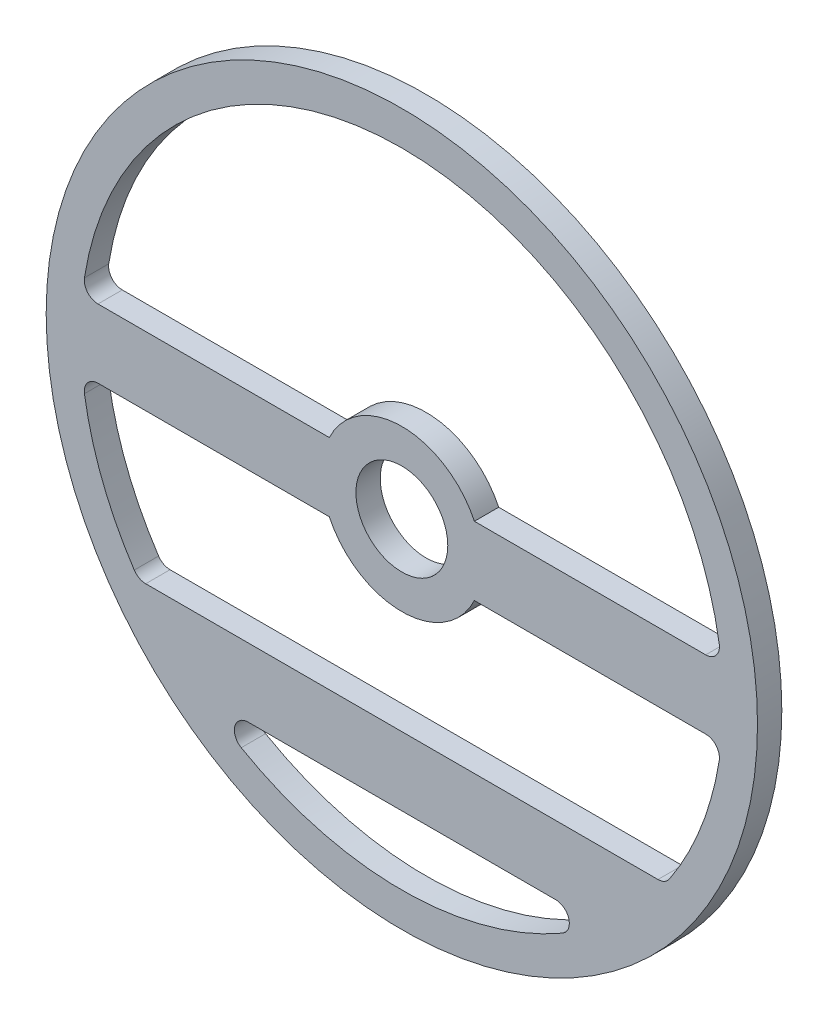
ISO-10303-21;
HEADER;
FILE_DESCRIPTION(('STEP AP214'),'2;1');
FILE_NAME('part.step','',(''),(''),'','','');
FILE_SCHEMA(('AUTOMOTIVE_DESIGN { 1 0 10303 214 1 1 1 1 }'));
ENDSEC;
DATA;
#1=APPLICATION_CONTEXT('core data for automotive mechanical design processes');
#2=APPLICATION_PROTOCOL_DEFINITION('international standard','automotive_design',2000,#1);
#3=PRODUCT_CONTEXT('',#1,'mechanical');
#4=PRODUCT('Part','Part','',(#3));
#5=PRODUCT_RELATED_PRODUCT_CATEGORY('part','',(#4));
#6=PRODUCT_DEFINITION_FORMATION('','',#4);
#7=PRODUCT_DEFINITION_CONTEXT('part definition',#1,'design');
#8=PRODUCT_DEFINITION('design','',#6,#7);
#9=PRODUCT_DEFINITION_SHAPE('','',#8);
#10=(LENGTH_UNIT() NAMED_UNIT(*) SI_UNIT(.MILLI.,.METRE.));
#11=(NAMED_UNIT(*) PLANE_ANGLE_UNIT() SI_UNIT($,.RADIAN.));
#12=(NAMED_UNIT(*) SI_UNIT($,.STERADIAN.) SOLID_ANGLE_UNIT());
#13=UNCERTAINTY_MEASURE_WITH_UNIT(LENGTH_MEASURE(1.E-05),#10,'distance_accuracy_value','');
#14=(GEOMETRIC_REPRESENTATION_CONTEXT(3) GLOBAL_UNCERTAINTY_ASSIGNED_CONTEXT((#13)) GLOBAL_UNIT_ASSIGNED_CONTEXT((#10,
#11,#12)) REPRESENTATION_CONTEXT('',''));
#15=CARTESIAN_POINT('',(0.,0.,0.));
#16=DIRECTION('',(0.,0.,1.));
#17=DIRECTION('',(1.,0.,0.));
#18=AXIS2_PLACEMENT_3D('',#15,#16,#17);
#19=CARTESIAN_POINT('',(0.,0.,4.5));
#20=DIRECTION('',(0.,0.,-1.));
#21=DIRECTION('',(-1.,0.,0.));
#22=AXIS2_PLACEMENT_3D('',#19,#20,#21);
#23=CYLINDRICAL_SURFACE('',#22,14.85);
#24=CARTESIAN_POINT('',(0.,0.,0.));
#25=DIRECTION('',(0.,0.,1.));
#26=DIRECTION('',(1.,0.,0.));
#27=AXIS2_PLACEMENT_3D('',#24,#25,#26);
#28=CIRCLE('',#27,14.85);
#29=CARTESIAN_POINT('',(-13.4238593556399,-6.35,0.));
#30=VERTEX_POINT('',#29);
#31=CARTESIAN_POINT('',(13.4238593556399,-6.35,0.));
#32=VERTEX_POINT('',#31);
#33=EDGE_CURVE('E325',#30,#32,#28,.T.);
#34=ORIENTED_EDGE('',*,*,#33,.T.);
#35=DIRECTION('',(0.,0.,-1.));
#36=VECTOR('',#35,1.);
#37=CARTESIAN_POINT('',(13.4238593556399,-6.35,4.5));
#38=LINE('',#37,#36);
#39=CARTESIAN_POINT('',(13.4238593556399,-6.35,4.5));
#40=VERTEX_POINT('',#39);
#41=EDGE_CURVE('E202',#40,#32,#38,.T.);
#42=ORIENTED_EDGE('',*,*,#41,.F.);
#43=CARTESIAN_POINT('',(0.,0.,4.5));
#44=DIRECTION('',(0.,0.,1.));
#45=DIRECTION('',(1.,0.,0.));
#46=AXIS2_PLACEMENT_3D('',#43,#44,#45);
#47=CIRCLE('',#46,14.85);
#48=CARTESIAN_POINT('',(-13.4238593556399,-6.35,4.5));
#49=VERTEX_POINT('',#48);
#50=EDGE_CURVE('E194',#49,#40,#47,.T.);
#51=ORIENTED_EDGE('',*,*,#50,.F.);
#52=DIRECTION('',(0.,0.,-1.));
#53=VECTOR('',#52,1.);
#54=CARTESIAN_POINT('',(-13.4238593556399,-6.35,4.5));
#55=LINE('',#54,#53);
#56=EDGE_CURVE('E199',#49,#30,#55,.T.);
#57=ORIENTED_EDGE('',*,*,#56,.T.);
#58=EDGE_LOOP('',(#34,#42,#51,#57));
#59=FACE_BOUND('',#58,.T.);
#60=ADVANCED_FACE('F35',(#59),#23,.T.);
#61=CARTESIAN_POINT('',(0.,-6.35,4.5));
#62=DIRECTION('',(0.,-1.,0.));
#63=DIRECTION('',(1.,0.,0.));
#64=AXIS2_PLACEMENT_3D('',#61,#62,#63);
#65=PLANE('',#64);
#66=DIRECTION('',(-1.,0.,0.));
#67=VECTOR('',#66,1.);
#68=CARTESIAN_POINT('',(0.,-6.35,0.));
#69=LINE('',#68,#67);
#70=CARTESIAN_POINT('',(56.234996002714,-6.34999999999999,0.));
#71=VERTEX_POINT('',#70);
#72=EDGE_CURVE('E313',#71,#32,#69,.T.);
#73=ORIENTED_EDGE('',*,*,#72,.F.);
#74=DIRECTION('',(0.,0.,1.));
#75=VECTOR('',#74,1.);
#76=CARTESIAN_POINT('',(56.234996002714,-6.34999999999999,4.5));
#77=LINE('',#76,#75);
#78=CARTESIAN_POINT('',(56.234996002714,-6.34999999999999,4.5));
#79=VERTEX_POINT('',#78);
#80=EDGE_CURVE('E230',#71,#79,#77,.T.);
#81=ORIENTED_EDGE('',*,*,#80,.T.);
#82=DIRECTION('',(-1.,0.,0.));
#83=VECTOR('',#82,1.);
#84=CARTESIAN_POINT('',(0.,-6.35,4.5));
#85=LINE('',#84,#83);
#86=EDGE_CURVE('E341',#79,#40,#85,.T.);
#87=ORIENTED_EDGE('',*,*,#86,.T.);
#88=ORIENTED_EDGE('',*,*,#41,.T.);
#89=EDGE_LOOP('',(#73,#81,#87,#88));
#90=FACE_BOUND('',#89,.T.);
#91=ADVANCED_FACE('F338',(#90),#65,.T.);
#92=CARTESIAN_POINT('',(0.,0.,4.5));
#93=DIRECTION('',(0.,0.,-1.));
#94=DIRECTION('',(-1.,0.,0.));
#95=AXIS2_PLACEMENT_3D('',#92,#93,#94);
#96=CYLINDRICAL_SURFACE('',#95,59.4733546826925);
#97=CARTESIAN_POINT('',(0.,0.,4.5));
#98=DIRECTION('',(0.,0.,1.));
#99=DIRECTION('',(1.,0.,0.));
#100=AXIS2_PLACEMENT_3D('',#97,#98,#99);
#101=CIRCLE('',#100,59.4733546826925);
#102=CARTESIAN_POINT('',(49.5179271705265,-32.9401700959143,4.5));
#103=VERTEX_POINT('',#102);
#104=CARTESIAN_POINT('',(58.7438397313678,-9.28661460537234,4.5));
#105=VERTEX_POINT('',#104);
#106=EDGE_CURVE('E353',#103,#105,#101,.T.);
#107=ORIENTED_EDGE('',*,*,#106,.T.);
#108=DIRECTION('',(0.,0.,-1.));
#109=VECTOR('',#108,1.);
#110=CARTESIAN_POINT('',(58.7438397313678,-9.28661460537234,4.5));
#111=LINE('',#110,#109);
#112=CARTESIAN_POINT('',(58.7438397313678,-9.28661460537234,0.));
#113=VERTEX_POINT('',#112);
#114=EDGE_CURVE('E227',#105,#113,#111,.T.);
#115=ORIENTED_EDGE('',*,*,#114,.T.);
#116=CARTESIAN_POINT('',(0.,0.,0.));
#117=DIRECTION('',(0.,0.,1.));
#118=DIRECTION('',(1.,0.,0.));
#119=AXIS2_PLACEMENT_3D('',#116,#117,#118);
#120=CIRCLE('',#119,59.4733546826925);
#121=CARTESIAN_POINT('',(49.5179271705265,-32.9401700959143,0.));
#122=VERTEX_POINT('',#121);
#123=EDGE_CURVE('E304',#122,#113,#120,.T.);
#124=ORIENTED_EDGE('',*,*,#123,.F.);
#125=DIRECTION('',(0.,0.,-1.));
#126=VECTOR('',#125,1.);
#127=CARTESIAN_POINT('',(49.5179271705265,-32.9401700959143,4.5));
#128=LINE('',#127,#126);
#129=EDGE_CURVE('E225',#122,#103,#128,.F.);
#130=ORIENTED_EDGE('',*,*,#129,.T.);
#131=EDGE_LOOP('',(#107,#115,#124,#130));
#132=FACE_BOUND('',#131,.T.);
#133=ADVANCED_FACE('F350',(#132),#96,.F.);
#134=CARTESIAN_POINT('',(0.,-34.0733546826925,4.5));
#135=DIRECTION('',(0.,1.,0.));
#136=DIRECTION('',(-1.,0.,0.));
#137=AXIS2_PLACEMENT_3D('',#134,#135,#136);
#138=PLANE('',#137);
#139=DIRECTION('',(1.,0.,0.));
#140=VECTOR('',#139,1.);
#141=CARTESIAN_POINT('',(0.,-34.0733546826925,4.5));
#142=LINE('',#141,#140);
#143=CARTESIAN_POINT('',(-47.4031055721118,-34.0733546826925,4.5));
#144=VERTEX_POINT('',#143);
#145=CARTESIAN_POINT('',(47.4031055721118,-34.0733546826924,4.5));
#146=VERTEX_POINT('',#145);
#147=EDGE_CURVE('E355',#144,#146,#142,.T.);
#148=ORIENTED_EDGE('',*,*,#147,.T.);
#149=DIRECTION('',(0.,0.,1.));
#150=VECTOR('',#149,1.);
#151=CARTESIAN_POINT('',(47.4031055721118,-34.0733546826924,0.));
#152=LINE('',#151,#150);
#153=CARTESIAN_POINT('',(47.4031055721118,-34.0733546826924,0.));
#154=VERTEX_POINT('',#153);
#155=EDGE_CURVE('E234',#146,#154,#152,.F.);
#156=ORIENTED_EDGE('',*,*,#155,.T.);
#157=DIRECTION('',(1.,0.,0.));
#158=VECTOR('',#157,1.);
#159=CARTESIAN_POINT('',(0.,-34.0733546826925,0.));
#160=LINE('',#159,#158);
#161=CARTESIAN_POINT('',(-47.4031055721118,-34.0733546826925,0.));
#162=VERTEX_POINT('',#161);
#163=EDGE_CURVE('E302',#162,#154,#160,.T.);
#164=ORIENTED_EDGE('',*,*,#163,.F.);
#165=DIRECTION('',(0.,0.,1.));
#166=VECTOR('',#165,1.);
#167=CARTESIAN_POINT('',(-47.4031055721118,-34.0733546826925,4.5));
#168=LINE('',#167,#166);
#169=EDGE_CURVE('E232',#162,#144,#168,.T.);
#170=ORIENTED_EDGE('',*,*,#169,.T.);
#171=EDGE_LOOP('',(#148,#156,#164,#170));
#172=FACE_BOUND('',#171,.T.);
#173=ADVANCED_FACE('F419',(#172),#138,.T.);
#174=CARTESIAN_POINT('',(-58.7438397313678,-9.28661460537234,4.5));
#175=VERTEX_POINT('',#174);
#176=CARTESIAN_POINT('',(-49.5179271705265,-32.9401700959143,4.5));
#177=VERTEX_POINT('',#176);
#178=EDGE_CURVE('E281',#175,#177,#101,.T.);
#179=ORIENTED_EDGE('',*,*,#178,.T.);
#180=DIRECTION('',(0.,0.,-1.));
#181=VECTOR('',#180,1.);
#182=CARTESIAN_POINT('',(-49.5179271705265,-32.9401700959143,4.5));
#183=LINE('',#182,#181);
#184=CARTESIAN_POINT('',(-49.5179271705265,-32.9401700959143,0.));
#185=VERTEX_POINT('',#184);
#186=EDGE_CURVE('E239',#177,#185,#183,.T.);
#187=ORIENTED_EDGE('',*,*,#186,.T.);
#188=CARTESIAN_POINT('',(-58.7438397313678,-9.28661460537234,0.));
#189=VERTEX_POINT('',#188);
#190=EDGE_CURVE('E297',#189,#185,#120,.T.);
#191=ORIENTED_EDGE('',*,*,#190,.F.);
#192=DIRECTION('',(0.,0.,-1.));
#193=VECTOR('',#192,1.);
#194=CARTESIAN_POINT('',(-58.7438397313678,-9.28661460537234,4.5));
#195=LINE('',#194,#193);
#196=EDGE_CURVE('E237',#189,#175,#195,.F.);
#197=ORIENTED_EDGE('',*,*,#196,.T.);
#198=EDGE_LOOP('',(#179,#187,#191,#197));
#199=FACE_BOUND('',#198,.T.);
#200=ADVANCED_FACE('F300',(#199),#96,.F.);
#201=CARTESIAN_POINT('',(0.,6.35,4.5));
#202=DIRECTION('',(0.,-1.,0.));
#203=DIRECTION('',(1.,0.,0.));
#204=AXIS2_PLACEMENT_3D('',#201,#202,#203);
#205=PLANE('',#204);
#206=DIRECTION('',(-1.,0.,0.));
#207=VECTOR('',#206,1.);
#208=CARTESIAN_POINT('',(0.,6.35,4.5));
#209=LINE('',#208,#207);
#210=CARTESIAN_POINT('',(56.234996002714,6.35,4.5));
#211=VERTEX_POINT('',#210);
#212=CARTESIAN_POINT('',(13.4238593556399,6.35,4.5));
#213=VERTEX_POINT('',#212);
#214=EDGE_CURVE('E170',#211,#213,#209,.T.);
#215=ORIENTED_EDGE('',*,*,#214,.F.);
#216=DIRECTION('',(0.,0.,-1.));
#217=VECTOR('',#216,1.);
#218=CARTESIAN_POINT('',(56.234996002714,6.35,4.5));
#219=LINE('',#218,#217);
#220=CARTESIAN_POINT('',(56.234996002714,6.35,0.));
#221=VERTEX_POINT('',#220);
#222=EDGE_CURVE('E218',#211,#221,#219,.T.);
#223=ORIENTED_EDGE('',*,*,#222,.T.);
#224=DIRECTION('',(-1.,0.,0.));
#225=VECTOR('',#224,1.);
#226=CARTESIAN_POINT('',(0.,6.35,0.));
#227=LINE('',#226,#225);
#228=CARTESIAN_POINT('',(13.4238593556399,6.35,0.));
#229=VERTEX_POINT('',#228);
#230=EDGE_CURVE('E197',#221,#229,#227,.T.);
#231=ORIENTED_EDGE('',*,*,#230,.T.);
#232=DIRECTION('',(0.,0.,-1.));
#233=VECTOR('',#232,1.);
#234=CARTESIAN_POINT('',(13.4238593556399,6.35,4.5));
#235=LINE('',#234,#233);
#236=EDGE_CURVE('E189',#213,#229,#235,.T.);
#237=ORIENTED_EDGE('',*,*,#236,.F.);
#238=EDGE_LOOP('',(#215,#223,#231,#237));
#239=FACE_BOUND('',#238,.T.);
#240=ADVANCED_FACE('F195',(#239),#205,.F.);
#241=CARTESIAN_POINT('',(-13.4238593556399,6.35,0.));
#242=VERTEX_POINT('',#241);
#243=EDGE_CURVE('E319',#229,#242,#28,.T.);
#244=ORIENTED_EDGE('',*,*,#243,.T.);
#245=DIRECTION('',(0.,0.,-1.));
#246=VECTOR('',#245,1.);
#247=CARTESIAN_POINT('',(-13.4238593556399,6.35,4.5));
#248=LINE('',#247,#246);
#249=CARTESIAN_POINT('',(-13.4238593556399,6.35,4.5));
#250=VERTEX_POINT('',#249);
#251=EDGE_CURVE('E191',#250,#242,#248,.T.);
#252=ORIENTED_EDGE('',*,*,#251,.F.);
#253=EDGE_CURVE('E175',#213,#250,#47,.T.);
#254=ORIENTED_EDGE('',*,*,#253,.F.);
#255=ORIENTED_EDGE('',*,*,#236,.T.);
#256=EDGE_LOOP('',(#244,#252,#254,#255));
#257=FACE_BOUND('',#256,.T.);
#258=ADVANCED_FACE('F188',(#257),#23,.T.);
#259=CARTESIAN_POINT('',(0.,6.35,4.5));
#260=DIRECTION('',(0.,1.,0.));
#261=DIRECTION('',(-1.,0.,0.));
#262=AXIS2_PLACEMENT_3D('',#259,#260,#261);
#263=PLANE('',#262);
#264=DIRECTION('',(1.,0.,0.));
#265=VECTOR('',#264,1.);
#266=CARTESIAN_POINT('',(0.,6.35,0.));
#267=LINE('',#266,#265);
#268=CARTESIAN_POINT('',(-56.234996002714,6.35,0.));
#269=VERTEX_POINT('',#268);
#270=EDGE_CURVE('E322',#269,#242,#267,.T.);
#271=ORIENTED_EDGE('',*,*,#270,.F.);
#272=DIRECTION('',(0.,0.,1.));
#273=VECTOR('',#272,1.);
#274=CARTESIAN_POINT('',(-56.234996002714,6.35,4.5));
#275=LINE('',#274,#273);
#276=CARTESIAN_POINT('',(-56.234996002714,6.35,4.5));
#277=VERTEX_POINT('',#276);
#278=EDGE_CURVE('E50',#269,#277,#275,.T.);
#279=ORIENTED_EDGE('',*,*,#278,.T.);
#280=DIRECTION('',(1.,0.,0.));
#281=VECTOR('',#280,1.);
#282=CARTESIAN_POINT('',(0.,6.35,4.5));
#283=LINE('',#282,#281);
#284=EDGE_CURVE('E192',#277,#250,#283,.T.);
#285=ORIENTED_EDGE('',*,*,#284,.T.);
#286=ORIENTED_EDGE('',*,*,#251,.T.);
#287=EDGE_LOOP('',(#271,#279,#285,#286));
#288=FACE_BOUND('',#287,.T.);
#289=ADVANCED_FACE('F410',(#288),#263,.T.);
#290=CARTESIAN_POINT('',(0.,-46.7733546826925,4.5));
#291=DIRECTION('',(0.,1.,0.));
#292=DIRECTION('',(-1.,0.,0.));
#293=AXIS2_PLACEMENT_3D('',#290,#291,#292);
#294=PLANE('',#293);
#295=DIRECTION('',(1.,0.,0.));
#296=VECTOR('',#295,1.);
#297=CARTESIAN_POINT('',(0.,-46.7733546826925,4.5));
#298=LINE('',#297,#296);
#299=CARTESIAN_POINT('',(-28.4534694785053,-46.7733546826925,4.5));
#300=VERTEX_POINT('',#299);
#301=CARTESIAN_POINT('',(28.4534694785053,-46.7733546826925,4.5));
#302=VERTEX_POINT('',#301);
#303=EDGE_CURVE('E332',#300,#302,#298,.T.);
#304=ORIENTED_EDGE('',*,*,#303,.F.);
#305=DIRECTION('',(0.,0.,-1.));
#306=VECTOR('',#305,1.);
#307=CARTESIAN_POINT('',(-28.4534694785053,-46.7733546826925,4.5));
#308=LINE('',#307,#306);
#309=CARTESIAN_POINT('',(-28.4534694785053,-46.7733546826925,0.));
#310=VERTEX_POINT('',#309);
#311=EDGE_CURVE('E210',#300,#310,#308,.T.);
#312=ORIENTED_EDGE('',*,*,#311,.T.);
#313=DIRECTION('',(1.,0.,0.));
#314=VECTOR('',#313,1.);
#315=CARTESIAN_POINT('',(0.,-46.7733546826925,0.));
#316=LINE('',#315,#314);
#317=CARTESIAN_POINT('',(28.4534694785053,-46.7733546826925,0.));
#318=VERTEX_POINT('',#317);
#319=EDGE_CURVE('E316',#310,#318,#316,.T.);
#320=ORIENTED_EDGE('',*,*,#319,.T.);
#321=DIRECTION('',(0.,0.,-1.));
#322=VECTOR('',#321,1.);
#323=CARTESIAN_POINT('',(28.4534694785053,-46.7733546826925,4.5));
#324=LINE('',#323,#322);
#325=EDGE_CURVE('E208',#318,#302,#324,.F.);
#326=ORIENTED_EDGE('',*,*,#325,.T.);
#327=EDGE_LOOP('',(#304,#312,#320,#326));
#328=FACE_BOUND('',#327,.T.);
#329=ADVANCED_FACE('F383',(#328),#294,.F.);
#330=CARTESIAN_POINT('',(0.,-6.35,4.5));
#331=DIRECTION('',(0.,1.,0.));
#332=DIRECTION('',(-1.,0.,0.));
#333=AXIS2_PLACEMENT_3D('',#330,#331,#332);
#334=PLANE('',#333);
#335=DIRECTION('',(1.,0.,0.));
#336=VECTOR('',#335,1.);
#337=CARTESIAN_POINT('',(0.,-6.35,4.5));
#338=LINE('',#337,#336);
#339=CARTESIAN_POINT('',(-56.234996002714,-6.34999999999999,4.5));
#340=VERTEX_POINT('',#339);
#341=EDGE_CURVE('E278',#340,#49,#338,.T.);
#342=ORIENTED_EDGE('',*,*,#341,.F.);
#343=DIRECTION('',(0.,0.,-1.));
#344=VECTOR('',#343,1.);
#345=CARTESIAN_POINT('',(-56.234996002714,-6.34999999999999,4.5));
#346=LINE('',#345,#344);
#347=CARTESIAN_POINT('',(-56.234996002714,-6.34999999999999,0.));
#348=VERTEX_POINT('',#347);
#349=EDGE_CURVE('E242',#340,#348,#346,.T.);
#350=ORIENTED_EDGE('',*,*,#349,.T.);
#351=DIRECTION('',(1.,0.,0.));
#352=VECTOR('',#351,1.);
#353=CARTESIAN_POINT('',(0.,-6.35,0.));
#354=LINE('',#353,#352);
#355=EDGE_CURVE('E298',#348,#30,#354,.T.);
#356=ORIENTED_EDGE('',*,*,#355,.T.);
#357=ORIENTED_EDGE('',*,*,#56,.F.);
#358=EDGE_LOOP('',(#342,#350,#356,#357));
#359=FACE_BOUND('',#358,.T.);
#360=ADVANCED_FACE('F286',(#359),#334,.F.);
#361=CARTESIAN_POINT('',(0.,0.,4.5));
#362=DIRECTION('',(0.,0.,-1.));
#363=DIRECTION('',(-1.,0.,0.));
#364=AXIS2_PLACEMENT_3D('',#361,#362,#363);
#365=CYLINDRICAL_SURFACE('',#364,8.5);
#366=CARTESIAN_POINT('',(0.,0.,4.5));
#367=DIRECTION('',(0.,0.,1.));
#368=DIRECTION('',(1.,0.,0.));
#369=AXIS2_PLACEMENT_3D('',#366,#367,#368);
#370=CIRCLE('',#369,8.5);
#371=CARTESIAN_POINT('',(8.5,0.,4.5));
#372=VERTEX_POINT('',#371);
#373=EDGE_CURVE('E363',#372,#372,#370,.T.);
#374=ORIENTED_EDGE('',*,*,#373,.T.);
#375=EDGE_LOOP('',(#374));
#376=FACE_BOUND('',#375,.T.);
#377=CARTESIAN_POINT('',(0.,0.,0.));
#378=DIRECTION('',(0.,0.,1.));
#379=DIRECTION('',(1.,0.,0.));
#380=AXIS2_PLACEMENT_3D('',#377,#378,#379);
#381=CIRCLE('',#380,8.5);
#382=CARTESIAN_POINT('',(8.5,0.,0.));
#383=VERTEX_POINT('',#382);
#384=EDGE_CURVE('E321',#383,#383,#381,.T.);
#385=ORIENTED_EDGE('',*,*,#384,.F.);
#386=EDGE_LOOP('',(#385));
#387=FACE_BOUND('',#386,.T.);
#388=ADVANCED_FACE('F389',(#376,#387),#365,.F.);
#389=CARTESIAN_POINT('',(58.7438397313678,9.28661460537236,0.));
#390=VERTEX_POINT('',#389);
#391=CARTESIAN_POINT('',(-58.7438397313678,9.28661460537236,0.));
#392=VERTEX_POINT('',#391);
#393=EDGE_CURVE('E314',#390,#392,#120,.T.);
#394=ORIENTED_EDGE('',*,*,#393,.F.);
#395=DIRECTION('',(0.,0.,-1.));
#396=VECTOR('',#395,1.);
#397=CARTESIAN_POINT('',(58.7438397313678,9.28661460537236,4.5));
#398=LINE('',#397,#396);
#399=CARTESIAN_POINT('',(58.7438397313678,9.28661460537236,4.5));
#400=VERTEX_POINT('',#399);
#401=EDGE_CURVE('E223',#390,#400,#398,.F.);
#402=ORIENTED_EDGE('',*,*,#401,.T.);
#403=CARTESIAN_POINT('',(-58.7438397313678,9.28661460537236,4.5));
#404=VERTEX_POINT('',#403);
#405=EDGE_CURVE('E357',#400,#404,#101,.T.);
#406=ORIENTED_EDGE('',*,*,#405,.T.);
#407=DIRECTION('',(0.,0.,-1.));
#408=VECTOR('',#407,1.);
#409=CARTESIAN_POINT('',(-58.7438397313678,9.28661460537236,4.5));
#410=LINE('',#409,#408);
#411=EDGE_CURVE('E220',#404,#392,#410,.T.);
#412=ORIENTED_EDGE('',*,*,#411,.T.);
#413=EDGE_LOOP('',(#394,#402,#406,#412));
#414=FACE_BOUND('',#413,.T.);
#415=ADVANCED_FACE('F391',(#414),#96,.F.);
#416=CARTESIAN_POINT('',(-29.7228802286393,-51.513399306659,0.));
#417=VERTEX_POINT('',#416);
#418=CARTESIAN_POINT('',(29.7228802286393,-51.513399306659,0.));
#419=VERTEX_POINT('',#418);
#420=EDGE_CURVE('E305',#417,#419,#120,.T.);
#421=ORIENTED_EDGE('',*,*,#420,.F.);
#422=DIRECTION('',(0.,0.,-1.));
#423=VECTOR('',#422,1.);
#424=CARTESIAN_POINT('',(-29.7228802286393,-51.513399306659,4.5));
#425=LINE('',#424,#423);
#426=CARTESIAN_POINT('',(-29.7228802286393,-51.513399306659,4.5));
#427=VERTEX_POINT('',#426);
#428=EDGE_CURVE('E216',#417,#427,#425,.F.);
#429=ORIENTED_EDGE('',*,*,#428,.T.);
#430=CARTESIAN_POINT('',(29.7228802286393,-51.513399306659,4.5));
#431=VERTEX_POINT('',#430);
#432=EDGE_CURVE('E183',#427,#431,#101,.T.);
#433=ORIENTED_EDGE('',*,*,#432,.T.);
#434=DIRECTION('',(0.,0.,-1.));
#435=VECTOR('',#434,1.);
#436=CARTESIAN_POINT('',(29.7228802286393,-51.513399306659,4.5));
#437=LINE('',#436,#435);
#438=EDGE_CURVE('E213',#431,#419,#437,.T.);
#439=ORIENTED_EDGE('',*,*,#438,.T.);
#440=EDGE_LOOP('',(#421,#429,#433,#439));
#441=FACE_BOUND('',#440,.T.);
#442=ADVANCED_FACE('F378',(#441),#96,.F.);
#443=CARTESIAN_POINT('',(0.,0.,4.5));
#444=DIRECTION('',(0.,0.,-1.));
#445=DIRECTION('',(-1.,0.,0.));
#446=AXIS2_PLACEMENT_3D('',#443,#444,#445);
#447=CYLINDRICAL_SURFACE('',#446,65.8233546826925);
#448=CARTESIAN_POINT('',(0.,0.,4.5));
#449=DIRECTION('',(0.,0.,1.));
#450=DIRECTION('',(1.,0.,0.));
#451=AXIS2_PLACEMENT_3D('',#448,#449,#450);
#452=CIRCLE('',#451,65.8233546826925);
#453=CARTESIAN_POINT('',(65.8233546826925,0.,4.5));
#454=VERTEX_POINT('',#453);
#455=EDGE_CURVE('E204',#454,#454,#452,.T.);
#456=ORIENTED_EDGE('',*,*,#455,.F.);
#457=EDGE_LOOP('',(#456));
#458=FACE_BOUND('',#457,.T.);
#459=CARTESIAN_POINT('',(0.,0.,0.));
#460=DIRECTION('',(0.,0.,1.));
#461=DIRECTION('',(1.,0.,0.));
#462=AXIS2_PLACEMENT_3D('',#459,#460,#461);
#463=CIRCLE('',#462,65.8233546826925);
#464=CARTESIAN_POINT('',(65.8233546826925,0.,0.));
#465=VERTEX_POINT('',#464);
#466=EDGE_CURVE('E306',#465,#465,#463,.T.);
#467=ORIENTED_EDGE('',*,*,#466,.T.);
#468=EDGE_LOOP('',(#467));
#469=FACE_BOUND('',#468,.T.);
#470=ADVANCED_FACE('F456',(#458,#469),#447,.T.);
#471=CARTESIAN_POINT('',(0.,0.,4.5));
#472=DIRECTION('',(0.,0.,1.));
#473=DIRECTION('',(1.,0.,0.));
#474=AXIS2_PLACEMENT_3D('',#471,#472,#473);
#475=PLANE('',#474);
#476=ORIENTED_EDGE('',*,*,#432,.F.);
#477=CARTESIAN_POINT('',(-28.4534694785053,-49.3133546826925,4.5));
#478=DIRECTION('',(0.,0.,1.));
#479=DIRECTION('',(1.,0.,0.));
#480=AXIS2_PLACEMENT_3D('',#477,#478,#479);
#481=CIRCLE('',#480,2.54);
#482=EDGE_CURVE('E248',#427,#300,#481,.F.);
#483=ORIENTED_EDGE('',*,*,#482,.T.);
#484=ORIENTED_EDGE('',*,*,#303,.T.);
#485=CARTESIAN_POINT('',(28.4534694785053,-49.3133546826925,4.5));
#486=DIRECTION('',(0.,0.,1.));
#487=DIRECTION('',(1.,0.,0.));
#488=AXIS2_PLACEMENT_3D('',#485,#486,#487);
#489=CIRCLE('',#488,2.54);
#490=EDGE_CURVE('E252',#302,#431,#489,.F.);
#491=ORIENTED_EDGE('',*,*,#490,.T.);
#492=EDGE_LOOP('',(#476,#483,#484,#491));
#493=FACE_BOUND('',#492,.T.);
#494=ORIENTED_EDGE('',*,*,#405,.F.);
#495=CARTESIAN_POINT('',(56.234996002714,8.89000000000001,4.5));
#496=DIRECTION('',(0.,0.,1.));
#497=DIRECTION('',(1.,0.,0.));
#498=AXIS2_PLACEMENT_3D('',#495,#496,#497);
#499=CIRCLE('',#498,2.54);
#500=EDGE_CURVE('E178',#400,#211,#499,.F.);
#501=ORIENTED_EDGE('',*,*,#500,.T.);
#502=ORIENTED_EDGE('',*,*,#214,.T.);
#503=ORIENTED_EDGE('',*,*,#253,.T.);
#504=ORIENTED_EDGE('',*,*,#284,.F.);
#505=CARTESIAN_POINT('',(-56.234996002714,8.89000000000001,4.5));
#506=DIRECTION('',(0.,0.,1.));
#507=DIRECTION('',(1.,0.,0.));
#508=AXIS2_PLACEMENT_3D('',#505,#506,#507);
#509=CIRCLE('',#508,2.54);
#510=EDGE_CURVE('E11',#277,#404,#509,.F.);
#511=ORIENTED_EDGE('',*,*,#510,.T.);
#512=EDGE_LOOP('',(#494,#501,#502,#503,#504,#511));
#513=FACE_BOUND('',#512,.T.);
#514=ORIENTED_EDGE('',*,*,#373,.F.);
#515=EDGE_LOOP('',(#514));
#516=FACE_BOUND('',#515,.T.);
#517=ORIENTED_EDGE('',*,*,#50,.T.);
#518=ORIENTED_EDGE('',*,*,#86,.F.);
#519=CARTESIAN_POINT('',(56.234996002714,-8.88999999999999,4.5));
#520=DIRECTION('',(0.,0.,1.));
#521=DIRECTION('',(1.,0.,0.));
#522=AXIS2_PLACEMENT_3D('',#519,#520,#521);
#523=CIRCLE('',#522,2.54);
#524=EDGE_CURVE('E259',#79,#105,#523,.F.);
#525=ORIENTED_EDGE('',*,*,#524,.T.);
#526=ORIENTED_EDGE('',*,*,#106,.F.);
#527=CARTESIAN_POINT('',(47.4031055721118,-31.5333546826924,4.5));
#528=DIRECTION('',(0.,0.,1.));
#529=DIRECTION('',(1.,0.,0.));
#530=AXIS2_PLACEMENT_3D('',#527,#528,#529);
#531=CIRCLE('',#530,2.54);
#532=EDGE_CURVE('E263',#103,#146,#531,.F.);
#533=ORIENTED_EDGE('',*,*,#532,.T.);
#534=ORIENTED_EDGE('',*,*,#147,.F.);
#535=CARTESIAN_POINT('',(-47.4031055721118,-31.5333546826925,4.5));
#536=DIRECTION('',(0.,0.,1.));
#537=DIRECTION('',(1.,0.,0.));
#538=AXIS2_PLACEMENT_3D('',#535,#536,#537);
#539=CIRCLE('',#538,2.54);
#540=EDGE_CURVE('E267',#144,#177,#539,.F.);
#541=ORIENTED_EDGE('',*,*,#540,.T.);
#542=ORIENTED_EDGE('',*,*,#178,.F.);
#543=CARTESIAN_POINT('',(-56.234996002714,-8.88999999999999,4.5));
#544=DIRECTION('',(0.,0.,1.));
#545=DIRECTION('',(1.,0.,0.));
#546=AXIS2_PLACEMENT_3D('',#543,#544,#545);
#547=CIRCLE('',#546,2.54);
#548=EDGE_CURVE('E271',#175,#340,#547,.F.);
#549=ORIENTED_EDGE('',*,*,#548,.T.);
#550=ORIENTED_EDGE('',*,*,#341,.T.);
#551=EDGE_LOOP('',(#517,#518,#525,#526,#533,#534,#541,#542,#549,#550));
#552=FACE_BOUND('',#551,.T.);
#553=ORIENTED_EDGE('',*,*,#455,.T.);
#554=EDGE_LOOP('',(#553));
#555=FACE_BOUND('',#554,.T.);
#556=ADVANCED_FACE('F173',(#493,#513,#516,#552,#555),#475,.T.);
#557=CARTESIAN_POINT('',(0.,0.,0.));
#558=DIRECTION('',(0.,0.,1.));
#559=DIRECTION('',(1.,0.,0.));
#560=AXIS2_PLACEMENT_3D('',#557,#558,#559);
#561=PLANE('',#560);
#562=ORIENTED_EDGE('',*,*,#319,.F.);
#563=CARTESIAN_POINT('',(-28.4534694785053,-49.3133546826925,0.));
#564=DIRECTION('',(0.,0.,1.));
#565=DIRECTION('',(1.,0.,0.));
#566=AXIS2_PLACEMENT_3D('',#563,#564,#565);
#567=CIRCLE('',#566,2.54);
#568=EDGE_CURVE('E246',#310,#417,#567,.T.);
#569=ORIENTED_EDGE('',*,*,#568,.T.);
#570=ORIENTED_EDGE('',*,*,#420,.T.);
#571=CARTESIAN_POINT('',(28.4534694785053,-49.3133546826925,0.));
#572=DIRECTION('',(0.,0.,1.));
#573=DIRECTION('',(1.,0.,0.));
#574=AXIS2_PLACEMENT_3D('',#571,#572,#573);
#575=CIRCLE('',#574,2.54);
#576=EDGE_CURVE('E250',#419,#318,#575,.T.);
#577=ORIENTED_EDGE('',*,*,#576,.T.);
#578=EDGE_LOOP('',(#562,#569,#570,#577));
#579=FACE_BOUND('',#578,.T.);
#580=ORIENTED_EDGE('',*,*,#230,.F.);
#581=CARTESIAN_POINT('',(56.234996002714,8.89000000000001,0.));
#582=DIRECTION('',(0.,0.,1.));
#583=DIRECTION('',(1.,0.,0.));
#584=AXIS2_PLACEMENT_3D('',#581,#582,#583);
#585=CIRCLE('',#584,2.54);
#586=EDGE_CURVE('E254',#221,#390,#585,.T.);
#587=ORIENTED_EDGE('',*,*,#586,.T.);
#588=ORIENTED_EDGE('',*,*,#393,.T.);
#589=CARTESIAN_POINT('',(-56.234996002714,8.89000000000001,0.));
#590=DIRECTION('',(0.,0.,1.));
#591=DIRECTION('',(1.,0.,0.));
#592=AXIS2_PLACEMENT_3D('',#589,#590,#591);
#593=CIRCLE('',#592,2.54);
#594=EDGE_CURVE('E43',#392,#269,#593,.T.);
#595=ORIENTED_EDGE('',*,*,#594,.T.);
#596=ORIENTED_EDGE('',*,*,#270,.T.);
#597=ORIENTED_EDGE('',*,*,#243,.F.);
#598=EDGE_LOOP('',(#580,#587,#588,#595,#596,#597));
#599=FACE_BOUND('',#598,.T.);
#600=ORIENTED_EDGE('',*,*,#384,.T.);
#601=EDGE_LOOP('',(#600));
#602=FACE_BOUND('',#601,.T.);
#603=ORIENTED_EDGE('',*,*,#33,.F.);
#604=ORIENTED_EDGE('',*,*,#355,.F.);
#605=CARTESIAN_POINT('',(-56.234996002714,-8.88999999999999,0.));
#606=DIRECTION('',(0.,0.,1.));
#607=DIRECTION('',(1.,0.,0.));
#608=AXIS2_PLACEMENT_3D('',#605,#606,#607);
#609=CIRCLE('',#608,2.54);
#610=EDGE_CURVE('E269',#348,#189,#609,.T.);
#611=ORIENTED_EDGE('',*,*,#610,.T.);
#612=ORIENTED_EDGE('',*,*,#190,.T.);
#613=CARTESIAN_POINT('',(-47.4031055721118,-31.5333546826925,0.));
#614=DIRECTION('',(0.,0.,1.));
#615=DIRECTION('',(1.,0.,0.));
#616=AXIS2_PLACEMENT_3D('',#613,#614,#615);
#617=CIRCLE('',#616,2.54);
#618=EDGE_CURVE('E265',#185,#162,#617,.T.);
#619=ORIENTED_EDGE('',*,*,#618,.T.);
#620=ORIENTED_EDGE('',*,*,#163,.T.);
#621=CARTESIAN_POINT('',(47.4031055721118,-31.5333546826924,0.));
#622=DIRECTION('',(0.,0.,1.));
#623=DIRECTION('',(1.,0.,0.));
#624=AXIS2_PLACEMENT_3D('',#621,#622,#623);
#625=CIRCLE('',#624,2.54);
#626=EDGE_CURVE('E261',#154,#122,#625,.T.);
#627=ORIENTED_EDGE('',*,*,#626,.T.);
#628=ORIENTED_EDGE('',*,*,#123,.T.);
#629=CARTESIAN_POINT('',(56.234996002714,-8.88999999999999,0.));
#630=DIRECTION('',(0.,0.,1.));
#631=DIRECTION('',(1.,0.,0.));
#632=AXIS2_PLACEMENT_3D('',#629,#630,#631);
#633=CIRCLE('',#632,2.54);
#634=EDGE_CURVE('E257',#113,#71,#633,.T.);
#635=ORIENTED_EDGE('',*,*,#634,.T.);
#636=ORIENTED_EDGE('',*,*,#72,.T.);
#637=EDGE_LOOP('',(#603,#604,#611,#612,#619,#620,#627,#628,#635,#636));
#638=FACE_BOUND('',#637,.T.);
#639=ORIENTED_EDGE('',*,*,#466,.F.);
#640=EDGE_LOOP('',(#639));
#641=FACE_BOUND('',#640,.T.);
#642=ADVANCED_FACE('F295',(#579,#599,#602,#638,#641),#561,.F.);
#643=CARTESIAN_POINT('',(-28.4534694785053,-49.3133546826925,4.5));
#644=DIRECTION('',(0.,0.,-1.));
#645=DIRECTION('',(-1.,0.,0.));
#646=AXIS2_PLACEMENT_3D('',#643,#644,#645);
#647=CYLINDRICAL_SURFACE('',#646,2.54);
#648=ORIENTED_EDGE('',*,*,#482,.F.);
#649=ORIENTED_EDGE('',*,*,#428,.F.);
#650=ORIENTED_EDGE('',*,*,#568,.F.);
#651=ORIENTED_EDGE('',*,*,#311,.F.);
#652=EDGE_LOOP('',(#648,#649,#650,#651));
#653=FACE_BOUND('',#652,.T.);
#654=ADVANCED_FACE('F381',(#653),#647,.F.);
#655=CARTESIAN_POINT('',(28.4534694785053,-49.3133546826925,4.5));
#656=DIRECTION('',(0.,0.,-1.));
#657=DIRECTION('',(-1.,0.,0.));
#658=AXIS2_PLACEMENT_3D('',#655,#656,#657);
#659=CYLINDRICAL_SURFACE('',#658,2.54);
#660=ORIENTED_EDGE('',*,*,#490,.F.);
#661=ORIENTED_EDGE('',*,*,#325,.F.);
#662=ORIENTED_EDGE('',*,*,#576,.F.);
#663=ORIENTED_EDGE('',*,*,#438,.F.);
#664=EDGE_LOOP('',(#660,#661,#662,#663));
#665=FACE_BOUND('',#664,.T.);
#666=ADVANCED_FACE('F377',(#665),#659,.F.);
#667=CARTESIAN_POINT('',(56.234996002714,8.89000000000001,4.5));
#668=DIRECTION('',(0.,0.,-1.));
#669=DIRECTION('',(-1.,0.,0.));
#670=AXIS2_PLACEMENT_3D('',#667,#668,#669);
#671=CYLINDRICAL_SURFACE('',#670,2.54);
#672=ORIENTED_EDGE('',*,*,#500,.F.);
#673=ORIENTED_EDGE('',*,*,#401,.F.);
#674=ORIENTED_EDGE('',*,*,#586,.F.);
#675=ORIENTED_EDGE('',*,*,#222,.F.);
#676=EDGE_LOOP('',(#672,#673,#674,#675));
#677=FACE_BOUND('',#676,.T.);
#678=ADVANCED_FACE('F427',(#677),#671,.F.);
#679=CARTESIAN_POINT('',(56.234996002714,-8.88999999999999,4.5));
#680=DIRECTION('',(0.,0.,-1.));
#681=DIRECTION('',(-1.,0.,0.));
#682=AXIS2_PLACEMENT_3D('',#679,#680,#681);
#683=CYLINDRICAL_SURFACE('',#682,2.54);
#684=ORIENTED_EDGE('',*,*,#524,.F.);
#685=ORIENTED_EDGE('',*,*,#80,.F.);
#686=ORIENTED_EDGE('',*,*,#634,.F.);
#687=ORIENTED_EDGE('',*,*,#114,.F.);
#688=EDGE_LOOP('',(#684,#685,#686,#687));
#689=FACE_BOUND('',#688,.T.);
#690=ADVANCED_FACE('F347',(#689),#683,.F.);
#691=CARTESIAN_POINT('',(47.4031055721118,-31.5333546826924,4.5));
#692=DIRECTION('',(0.,0.,-1.));
#693=DIRECTION('',(-1.,0.,0.));
#694=AXIS2_PLACEMENT_3D('',#691,#692,#693);
#695=CYLINDRICAL_SURFACE('',#694,2.54);
#696=ORIENTED_EDGE('',*,*,#532,.F.);
#697=ORIENTED_EDGE('',*,*,#129,.F.);
#698=ORIENTED_EDGE('',*,*,#626,.F.);
#699=ORIENTED_EDGE('',*,*,#155,.F.);
#700=EDGE_LOOP('',(#696,#697,#698,#699));
#701=FACE_BOUND('',#700,.T.);
#702=ADVANCED_FACE('F433',(#701),#695,.F.);
#703=CARTESIAN_POINT('',(-47.4031055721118,-31.5333546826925,4.5));
#704=DIRECTION('',(0.,0.,-1.));
#705=DIRECTION('',(-1.,0.,0.));
#706=AXIS2_PLACEMENT_3D('',#703,#704,#705);
#707=CYLINDRICAL_SURFACE('',#706,2.54);
#708=ORIENTED_EDGE('',*,*,#540,.F.);
#709=ORIENTED_EDGE('',*,*,#169,.F.);
#710=ORIENTED_EDGE('',*,*,#618,.F.);
#711=ORIENTED_EDGE('',*,*,#186,.F.);
#712=EDGE_LOOP('',(#708,#709,#710,#711));
#713=FACE_BOUND('',#712,.T.);
#714=ADVANCED_FACE('F436',(#713),#707,.F.);
#715=CARTESIAN_POINT('',(-56.234996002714,-8.88999999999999,4.5));
#716=DIRECTION('',(0.,0.,-1.));
#717=DIRECTION('',(-1.,0.,0.));
#718=AXIS2_PLACEMENT_3D('',#715,#716,#717);
#719=CYLINDRICAL_SURFACE('',#718,2.54);
#720=ORIENTED_EDGE('',*,*,#548,.F.);
#721=ORIENTED_EDGE('',*,*,#196,.F.);
#722=ORIENTED_EDGE('',*,*,#610,.F.);
#723=ORIENTED_EDGE('',*,*,#349,.F.);
#724=EDGE_LOOP('',(#720,#721,#722,#723));
#725=FACE_BOUND('',#724,.T.);
#726=ADVANCED_FACE('F290',(#725),#719,.F.);
#727=CARTESIAN_POINT('',(-56.234996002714,8.89000000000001,4.5));
#728=DIRECTION('',(0.,0.,-1.));
#729=DIRECTION('',(-1.,0.,0.));
#730=AXIS2_PLACEMENT_3D('',#727,#728,#729);
#731=CYLINDRICAL_SURFACE('',#730,2.54);
#732=ORIENTED_EDGE('',*,*,#510,.F.);
#733=ORIENTED_EDGE('',*,*,#278,.F.);
#734=ORIENTED_EDGE('',*,*,#594,.F.);
#735=ORIENTED_EDGE('',*,*,#411,.F.);
#736=EDGE_LOOP('',(#732,#733,#734,#735));
#737=FACE_BOUND('',#736,.T.);
#738=ADVANCED_FACE('F37',(#737),#731,.F.);
#739=CLOSED_SHELL('',(#60,#91,#133,#173,#200,#240,#258,#289,#329,#360,#388,#415,#442,#470,#556,
#642,#654,#666,#678,#690,#702,#714,#726,#738));
#740=MANIFOLD_SOLID_BREP('B2',#739);
#741=ADVANCED_BREP_SHAPE_REPRESENTATION('',(#18,#740),#14);
#742=SHAPE_DEFINITION_REPRESENTATION(#9,#741);
ENDSEC;
END-ISO-10303-21;
